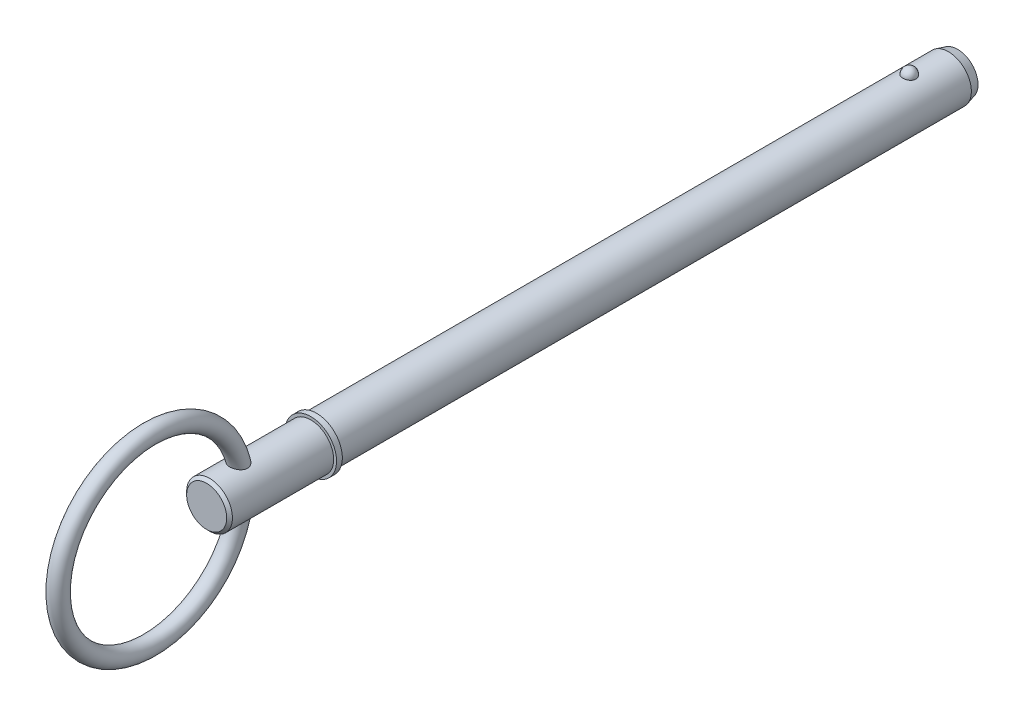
from build123d import *

# Parameters (mm, degrees)
SKETCH2_R           = 3.97
BOSS_EXTRUDE1_DEPTH = 101.6
BOSS_EXTRUDE2_START = 9.53
SKETCH3_R           = 3.97
BOSS_EXTRUDE2_DEPTH = 9.53
CHAMFER1_SIZE       = 1.586
CHAMFER1_SIZE2      = 0.424967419
SKETCH20_W          = 1
SKETCH20_H          = 4.47
SKETCH21_R          = 3.97
BOSS_EXTRUDE3_DEPTH = 19.05
CHAMFER2_SIZE       = 0.5
SKETCH24_R          = 1.5


with BuildPart() as part:
    # Sketch2 → Boss-Extrude1 (new body)
    with BuildSketch(Plane.XY):
        Circle(SKETCH2_R)
    extrude(amount=BOSS_EXTRUDE1_DEPTH)

    # Sketch3 → Boss-Extrude2 (add)
    with BuildSketch(Plane(origin=(0, 0, 0), x_dir=(-1, 0, 0), z_dir=(0, 0, -1)).offset(BOSS_EXTRUDE2_START)):
        Circle(SKETCH3_R)
    extrude(amount=-BOSS_EXTRUDE2_DEPTH)

    # Chamfer1
    chamfer1_edges = [part.edges().sort_by_distance(p)[0] for p in [
        (3.97, 0, -9.53),
    ]]
    chamfer1_side = [part.faces().sort_by_distance(p)[0] for p in [
        (3.97, 0, -4.765),
    ]]
    chamfer(chamfer1_edges, length=CHAMFER1_SIZE, length2=CHAMFER1_SIZE2, reference=chamfer1_side[0])

    # Sketch18 → Revolve1 (revolve)
    with BuildSketch(Plane(origin=(0, 0, 0), x_dir=(0, 0, -1), z_dir=(1, 0, 0))):
        with BuildLine():
            Line((1.15, 5.12), (1.15, 2.82))
            ThreePointArc((1.15, 2.82), (0, 3.97), (1.15, 5.12))
        make_face()
    revolve(axis=Axis((0, 5.12, -1.15), (0, -1, 0)))

    # Sketch20 → Revolve2 (revolve)
    with BuildSketch(Plane(origin=(0, 0, 0), x_dir=(0, 0, -1), z_dir=(1, 0, 0)), mode=Mode.PRIVATE) as revolve2_sk:
        with Locations((-102.1, 2.235)):
            Rectangle(SKETCH20_W, SKETCH20_H)
    revolve(revolve2_sk.sketch.rotate(Axis((0, 0, 33.728787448), (0, 0, 1)), 90), axis=Axis((0, 0, 33.728787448), (0, 0, 1)))

    # Sketch21 → Boss-Extrude3 (add)
    with BuildSketch(Plane(origin=(0, 0, 101.6), x_dir=(-1, 0, 0), z_dir=(0, 0, -1))):
        Circle(SKETCH21_R)
    extrude(amount=-BOSS_EXTRUDE3_DEPTH)

    # Chamfer2
    chamfer2_edges = [part.edges().sort_by_distance(p)[0] for p in [
        (3.97, 0, 120.65),
    ]]
    chamfer(chamfer2_edges, length=CHAMFER2_SIZE)

    # Sweep1: sweep along a path in Sketch23
    with BuildLine(Plane(origin=(0, 0, 0), x_dir=(0, 0, -1), z_dir=(1, 0, 0))) as sweep1_path:
        CenterArc((-130.525, 0), 15.875, 0, 360)
    # Sketch24 → Sweep1 (sweep)
    with BuildSketch(Plane(origin=(0, 0, 0), x_dir=(1, 0, 0), z_dir=(0, 1, 0))):
        with Locations((0, -114.65)):
            Circle(SKETCH24_R)
    sweep(path=sweep1_path.line)


solid = part.part
